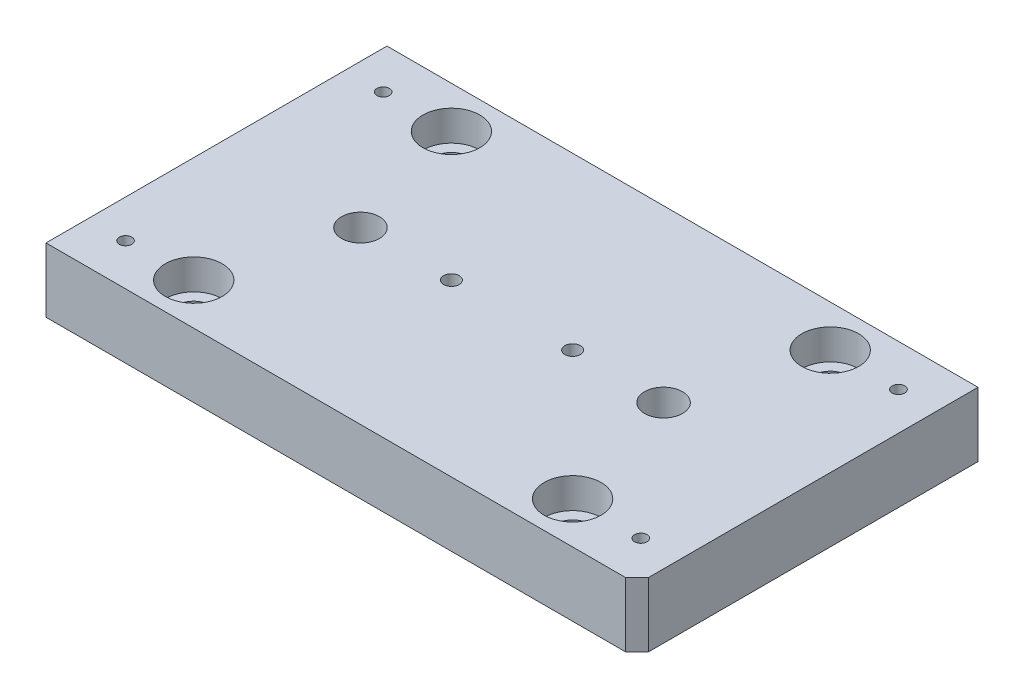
ISO-10303-21;
HEADER;
FILE_DESCRIPTION(('STEP AP214'),'2;1');
FILE_NAME('part.step','',(''),(''),'','','');
FILE_SCHEMA(('AUTOMOTIVE_DESIGN { 1 0 10303 214 1 1 1 1 }'));
ENDSEC;
DATA;
#1=APPLICATION_CONTEXT('core data for automotive mechanical design processes');
#2=APPLICATION_PROTOCOL_DEFINITION('international standard','automotive_design',2000,#1);
#3=PRODUCT_CONTEXT('',#1,'mechanical');
#4=PRODUCT('Part','Part','',(#3));
#5=PRODUCT_RELATED_PRODUCT_CATEGORY('part','',(#4));
#6=PRODUCT_DEFINITION_FORMATION('','',#4);
#7=PRODUCT_DEFINITION_CONTEXT('part definition',#1,'design');
#8=PRODUCT_DEFINITION('design','',#6,#7);
#9=PRODUCT_DEFINITION_SHAPE('','',#8);
#10=(LENGTH_UNIT() NAMED_UNIT(*) SI_UNIT(.MILLI.,.METRE.));
#11=(NAMED_UNIT(*) PLANE_ANGLE_UNIT() SI_UNIT($,.RADIAN.));
#12=(NAMED_UNIT(*) SI_UNIT($,.STERADIAN.) SOLID_ANGLE_UNIT());
#13=UNCERTAINTY_MEASURE_WITH_UNIT(LENGTH_MEASURE(1.E-05),#10,'distance_accuracy_value','');
#14=(GEOMETRIC_REPRESENTATION_CONTEXT(3) GLOBAL_UNCERTAINTY_ASSIGNED_CONTEXT((#13)) GLOBAL_UNIT_ASSIGNED_CONTEXT((#10,
#11,#12)) REPRESENTATION_CONTEXT('',''));
#15=CARTESIAN_POINT('',(0.,0.,0.));
#16=DIRECTION('',(0.,0.,1.));
#17=DIRECTION('',(1.,0.,0.));
#18=AXIS2_PLACEMENT_3D('',#15,#16,#17);
#19=CARTESIAN_POINT('',(-16.,0.,0.));
#20=DIRECTION('',(0.,1.,0.));
#21=DIRECTION('',(0.,0.,1.));
#22=AXIS2_PLACEMENT_3D('',#19,#20,#21);
#23=CYLINDRICAL_SURFACE('',#22,2.05);
#24=CARTESIAN_POINT('',(-16.,17.,0.));
#25=DIRECTION('',(0.,1.,0.));
#26=DIRECTION('',(0.,0.,1.));
#27=AXIS2_PLACEMENT_3D('',#24,#25,#26);
#28=CIRCLE('',#27,2.05);
#29=CARTESIAN_POINT('',(-16.,17.,2.05));
#30=VERTEX_POINT('',#29);
#31=EDGE_CURVE('E174',#30,#30,#28,.T.);
#32=ORIENTED_EDGE('',*,*,#31,.T.);
#33=EDGE_LOOP('',(#32));
#34=FACE_BOUND('',#33,.T.);
#35=CARTESIAN_POINT('',(-16.,8.,0.));
#36=DIRECTION('',(0.,-1.,0.));
#37=DIRECTION('',(0.,0.,-1.));
#38=AXIS2_PLACEMENT_3D('',#35,#36,#37);
#39=CIRCLE('',#38,2.05);
#40=CARTESIAN_POINT('',(-16.,8.,-2.05));
#41=VERTEX_POINT('',#40);
#42=EDGE_CURVE('E176',#41,#41,#39,.F.);
#43=ORIENTED_EDGE('',*,*,#42,.F.);
#44=EDGE_LOOP('',(#43));
#45=FACE_BOUND('',#44,.T.);
#46=ADVANCED_FACE('F50',(#34,#45),#23,.F.);
#47=CARTESIAN_POINT('',(16.,0.,0.));
#48=DIRECTION('',(0.,1.,0.));
#49=DIRECTION('',(0.,0.,1.));
#50=AXIS2_PLACEMENT_3D('',#47,#48,#49);
#51=CYLINDRICAL_SURFACE('',#50,2.05);
#52=CARTESIAN_POINT('',(16.,17.,0.));
#53=DIRECTION('',(0.,1.,0.));
#54=DIRECTION('',(0.,0.,1.));
#55=AXIS2_PLACEMENT_3D('',#52,#53,#54);
#56=CIRCLE('',#55,2.05);
#57=CARTESIAN_POINT('',(16.,17.,2.05));
#58=VERTEX_POINT('',#57);
#59=EDGE_CURVE('E627',#58,#58,#56,.T.);
#60=ORIENTED_EDGE('',*,*,#59,.T.);
#61=EDGE_LOOP('',(#60));
#62=FACE_BOUND('',#61,.T.);
#63=CARTESIAN_POINT('',(16.,8.,0.));
#64=DIRECTION('',(0.,-1.,0.));
#65=DIRECTION('',(0.,0.,-1.));
#66=AXIS2_PLACEMENT_3D('',#63,#64,#65);
#67=CIRCLE('',#66,2.05);
#68=CARTESIAN_POINT('',(16.,8.,-2.05));
#69=VERTEX_POINT('',#68);
#70=EDGE_CURVE('E171',#69,#69,#67,.F.);
#71=ORIENTED_EDGE('',*,*,#70,.F.);
#72=EDGE_LOOP('',(#71));
#73=FACE_BOUND('',#72,.T.);
#74=ADVANCED_FACE('F217',(#62,#73),#51,.F.);
#75=CARTESIAN_POINT('',(-78.,17.,-45.));
#76=DIRECTION('',(1.,0.,0.));
#77=DIRECTION('',(0.,0.,-1.));
#78=AXIS2_PLACEMENT_3D('',#75,#76,#77);
#79=PLANE('',#78);
#80=DIRECTION('',(0.,0.,1.));
#81=VECTOR('',#80,1.);
#82=CARTESIAN_POINT('',(-78.,0.,-45.));
#83=LINE('',#82,#81);
#84=CARTESIAN_POINT('',(-78.,0.,-45.));
#85=VERTEX_POINT('',#84);
#86=CARTESIAN_POINT('',(-78.,0.,45.));
#87=VERTEX_POINT('',#86);
#88=EDGE_CURVE('E143',#85,#87,#83,.T.);
#89=ORIENTED_EDGE('',*,*,#88,.T.);
#90=DIRECTION('',(0.,-1.,0.));
#91=VECTOR('',#90,1.);
#92=CARTESIAN_POINT('',(-78.,17.,45.));
#93=LINE('',#92,#91);
#94=CARTESIAN_POINT('',(-78.,17.,45.));
#95=VERTEX_POINT('',#94);
#96=EDGE_CURVE('E167',#95,#87,#93,.T.);
#97=ORIENTED_EDGE('',*,*,#96,.F.);
#98=DIRECTION('',(0.,0.,1.));
#99=VECTOR('',#98,1.);
#100=CARTESIAN_POINT('',(-78.,17.,-45.));
#101=LINE('',#100,#99);
#102=CARTESIAN_POINT('',(-78.,17.,-45.));
#103=VERTEX_POINT('',#102);
#104=EDGE_CURVE('E152',#103,#95,#101,.T.);
#105=ORIENTED_EDGE('',*,*,#104,.F.);
#106=DIRECTION('',(0.,-1.,0.));
#107=VECTOR('',#106,1.);
#108=CARTESIAN_POINT('',(-78.,17.,-45.));
#109=LINE('',#108,#107);
#110=EDGE_CURVE('E161',#103,#85,#109,.T.);
#111=ORIENTED_EDGE('',*,*,#110,.T.);
#112=EDGE_LOOP('',(#89,#97,#105,#111));
#113=FACE_BOUND('',#112,.T.);
#114=ADVANCED_FACE('F199',(#113),#79,.F.);
#115=CARTESIAN_POINT('',(-78.,17.,45.));
#116=DIRECTION('',(0.,0.,-1.));
#117=DIRECTION('',(-1.,0.,0.));
#118=AXIS2_PLACEMENT_3D('',#115,#116,#117);
#119=PLANE('',#118);
#120=DIRECTION('',(1.,0.,0.));
#121=VECTOR('',#120,1.);
#122=CARTESIAN_POINT('',(-78.,0.,45.));
#123=LINE('',#122,#121);
#124=CARTESIAN_POINT('',(75.,0.,45.));
#125=VERTEX_POINT('',#124);
#126=EDGE_CURVE('E146',#87,#125,#123,.T.);
#127=ORIENTED_EDGE('',*,*,#126,.T.);
#128=DIRECTION('',(0.,1.,0.));
#129=VECTOR('',#128,1.);
#130=CARTESIAN_POINT('',(75.,17.,45.));
#131=LINE('',#130,#129);
#132=CARTESIAN_POINT('',(75.,17.,45.));
#133=VERTEX_POINT('',#132);
#134=EDGE_CURVE('E58',#125,#133,#131,.T.);
#135=ORIENTED_EDGE('',*,*,#134,.T.);
#136=DIRECTION('',(1.,0.,0.));
#137=VECTOR('',#136,1.);
#138=CARTESIAN_POINT('',(-78.,17.,45.));
#139=LINE('',#138,#137);
#140=EDGE_CURVE('E155',#95,#133,#139,.T.);
#141=ORIENTED_EDGE('',*,*,#140,.F.);
#142=ORIENTED_EDGE('',*,*,#96,.T.);
#143=EDGE_LOOP('',(#127,#135,#141,#142));
#144=FACE_BOUND('',#143,.T.);
#145=ADVANCED_FACE('F315',(#144),#119,.F.);
#146=CARTESIAN_POINT('',(78.,17.,-45.));
#147=DIRECTION('',(-1.,0.,0.));
#148=DIRECTION('',(0.,0.,1.));
#149=AXIS2_PLACEMENT_3D('',#146,#147,#148);
#150=PLANE('',#149);
#151=DIRECTION('',(0.,0.,-1.));
#152=VECTOR('',#151,1.);
#153=CARTESIAN_POINT('',(78.,17.,-45.));
#154=LINE('',#153,#152);
#155=CARTESIAN_POINT('',(78.,17.,42.));
#156=VERTEX_POINT('',#155);
#157=CARTESIAN_POINT('',(78.,17.,-45.));
#158=VERTEX_POINT('',#157);
#159=EDGE_CURVE('E157',#156,#158,#154,.T.);
#160=ORIENTED_EDGE('',*,*,#159,.F.);
#161=DIRECTION('',(0.,-1.,0.));
#162=VECTOR('',#161,1.);
#163=CARTESIAN_POINT('',(78.,17.,42.));
#164=LINE('',#163,#162);
#165=CARTESIAN_POINT('',(78.,0.,42.));
#166=VERTEX_POINT('',#165);
#167=EDGE_CURVE('E170',#156,#166,#164,.T.);
#168=ORIENTED_EDGE('',*,*,#167,.T.);
#169=DIRECTION('',(0.,0.,-1.));
#170=VECTOR('',#169,1.);
#171=CARTESIAN_POINT('',(78.,0.,-45.));
#172=LINE('',#171,#170);
#173=CARTESIAN_POINT('',(78.,0.,-45.));
#174=VERTEX_POINT('',#173);
#175=EDGE_CURVE('E148',#166,#174,#172,.T.);
#176=ORIENTED_EDGE('',*,*,#175,.T.);
#177=DIRECTION('',(0.,-1.,0.));
#178=VECTOR('',#177,1.);
#179=CARTESIAN_POINT('',(78.,17.,-45.));
#180=LINE('',#179,#178);
#181=EDGE_CURVE('E164',#158,#174,#180,.T.);
#182=ORIENTED_EDGE('',*,*,#181,.F.);
#183=EDGE_LOOP('',(#160,#168,#176,#182));
#184=FACE_BOUND('',#183,.T.);
#185=ADVANCED_FACE('F186',(#184),#150,.F.);
#186=CARTESIAN_POINT('',(-78.,17.,-45.));
#187=DIRECTION('',(0.,0.,1.));
#188=DIRECTION('',(1.,0.,0.));
#189=AXIS2_PLACEMENT_3D('',#186,#187,#188);
#190=PLANE('',#189);
#191=DIRECTION('',(-1.,0.,0.));
#192=VECTOR('',#191,1.);
#193=CARTESIAN_POINT('',(-78.,0.,-45.));
#194=LINE('',#193,#192);
#195=EDGE_CURVE('E150',#174,#85,#194,.T.);
#196=ORIENTED_EDGE('',*,*,#195,.T.);
#197=ORIENTED_EDGE('',*,*,#110,.F.);
#198=DIRECTION('',(-1.,0.,0.));
#199=VECTOR('',#198,1.);
#200=CARTESIAN_POINT('',(-78.,17.,-45.));
#201=LINE('',#200,#199);
#202=EDGE_CURVE('E159',#158,#103,#201,.T.);
#203=ORIENTED_EDGE('',*,*,#202,.F.);
#204=ORIENTED_EDGE('',*,*,#181,.T.);
#205=EDGE_LOOP('',(#196,#197,#203,#204));
#206=FACE_BOUND('',#205,.T.);
#207=ADVANCED_FACE('F195',(#206),#190,.F.);
#208=CARTESIAN_POINT('',(-78.,17.,45.));
#209=DIRECTION('',(0.,1.,0.));
#210=DIRECTION('',(0.,0.,1.));
#211=AXIS2_PLACEMENT_3D('',#208,#209,#210);
#212=PLANE('',#211);
#213=CARTESIAN_POINT('',(-40.,17.,0.));
#214=DIRECTION('',(0.,-1.,0.));
#215=DIRECTION('',(0.,0.,-1.));
#216=AXIS2_PLACEMENT_3D('',#213,#214,#215);
#217=CIRCLE('',#216,5.);
#218=CARTESIAN_POINT('',(-40.,17.,-5.));
#219=VERTEX_POINT('',#218);
#220=EDGE_CURVE('E604',#219,#219,#217,.T.);
#221=ORIENTED_EDGE('',*,*,#220,.T.);
#222=EDGE_LOOP('',(#221));
#223=FACE_BOUND('',#222,.T.);
#224=CARTESIAN_POINT('',(40.,17.,0.));
#225=DIRECTION('',(0.,-1.,0.));
#226=DIRECTION('',(0.,0.,-1.));
#227=AXIS2_PLACEMENT_3D('',#224,#225,#226);
#228=CIRCLE('',#227,5.);
#229=CARTESIAN_POINT('',(40.,17.,-5.));
#230=VERTEX_POINT('',#229);
#231=EDGE_CURVE('E612',#230,#230,#228,.T.);
#232=ORIENTED_EDGE('',*,*,#231,.T.);
#233=EDGE_LOOP('',(#232));
#234=FACE_BOUND('',#233,.T.);
#235=ORIENTED_EDGE('',*,*,#31,.F.);
#236=EDGE_LOOP('',(#235));
#237=FACE_BOUND('',#236,.T.);
#238=ORIENTED_EDGE('',*,*,#59,.F.);
#239=EDGE_LOOP('',(#238));
#240=FACE_BOUND('',#239,.T.);
#241=CARTESIAN_POINT('',(50.,17.,34.));
#242=DIRECTION('',(0.,1.,0.));
#243=DIRECTION('',(0.,0.,1.));
#244=AXIS2_PLACEMENT_3D('',#241,#242,#243);
#245=CIRCLE('',#244,7.5);
#246=CARTESIAN_POINT('',(50.,17.,41.5));
#247=VERTEX_POINT('',#246);
#248=EDGE_CURVE('E630',#247,#247,#245,.T.);
#249=ORIENTED_EDGE('',*,*,#248,.F.);
#250=EDGE_LOOP('',(#249));
#251=FACE_BOUND('',#250,.T.);
#252=CARTESIAN_POINT('',(50.,17.,-34.));
#253=DIRECTION('',(0.,1.,0.));
#254=DIRECTION('',(0.,0.,1.));
#255=AXIS2_PLACEMENT_3D('',#252,#253,#254);
#256=CIRCLE('',#255,7.5);
#257=CARTESIAN_POINT('',(50.,17.,-26.5));
#258=VERTEX_POINT('',#257);
#259=EDGE_CURVE('E642',#258,#258,#256,.T.);
#260=ORIENTED_EDGE('',*,*,#259,.F.);
#261=EDGE_LOOP('',(#260));
#262=FACE_BOUND('',#261,.T.);
#263=CARTESIAN_POINT('',(-50.,17.,-34.));
#264=DIRECTION('',(0.,1.,0.));
#265=DIRECTION('',(0.,0.,1.));
#266=AXIS2_PLACEMENT_3D('',#263,#264,#265);
#267=CIRCLE('',#266,7.5);
#268=CARTESIAN_POINT('',(-50.,17.,-26.5));
#269=VERTEX_POINT('',#268);
#270=EDGE_CURVE('E654',#269,#269,#267,.T.);
#271=ORIENTED_EDGE('',*,*,#270,.F.);
#272=EDGE_LOOP('',(#271));
#273=FACE_BOUND('',#272,.T.);
#274=CARTESIAN_POINT('',(-50.,17.,34.));
#275=DIRECTION('',(0.,1.,0.));
#276=DIRECTION('',(0.,0.,1.));
#277=AXIS2_PLACEMENT_3D('',#274,#275,#276);
#278=CIRCLE('',#277,7.5);
#279=CARTESIAN_POINT('',(-50.,17.,41.5));
#280=VERTEX_POINT('',#279);
#281=EDGE_CURVE('E666',#280,#280,#278,.T.);
#282=ORIENTED_EDGE('',*,*,#281,.F.);
#283=EDGE_LOOP('',(#282));
#284=FACE_BOUND('',#283,.T.);
#285=CARTESIAN_POINT('',(68.,17.,34.));
#286=DIRECTION('',(0.,1.,0.));
#287=DIRECTION('',(0.,0.,1.));
#288=AXIS2_PLACEMENT_3D('',#285,#286,#287);
#289=CIRCLE('',#288,1.65);
#290=CARTESIAN_POINT('',(68.,17.,35.65));
#291=VERTEX_POINT('',#290);
#292=EDGE_CURVE('E115',#291,#291,#289,.T.);
#293=ORIENTED_EDGE('',*,*,#292,.F.);
#294=EDGE_LOOP('',(#293));
#295=FACE_BOUND('',#294,.T.);
#296=CARTESIAN_POINT('',(68.,17.,-34.));
#297=DIRECTION('',(0.,1.,0.));
#298=DIRECTION('',(0.,0.,1.));
#299=AXIS2_PLACEMENT_3D('',#296,#297,#298);
#300=CIRCLE('',#299,1.65);
#301=CARTESIAN_POINT('',(68.,17.,-32.35));
#302=VERTEX_POINT('',#301);
#303=EDGE_CURVE('E128',#302,#302,#300,.T.);
#304=ORIENTED_EDGE('',*,*,#303,.F.);
#305=EDGE_LOOP('',(#304));
#306=FACE_BOUND('',#305,.T.);
#307=CARTESIAN_POINT('',(-68.,17.,-34.));
#308=DIRECTION('',(0.,1.,0.));
#309=DIRECTION('',(0.,0.,1.));
#310=AXIS2_PLACEMENT_3D('',#307,#308,#309);
#311=CIRCLE('',#310,1.65);
#312=CARTESIAN_POINT('',(-68.,17.,-32.35));
#313=VERTEX_POINT('',#312);
#314=EDGE_CURVE('E134',#313,#313,#311,.T.);
#315=ORIENTED_EDGE('',*,*,#314,.F.);
#316=EDGE_LOOP('',(#315));
#317=FACE_BOUND('',#316,.T.);
#318=CARTESIAN_POINT('',(-68.,17.,34.));
#319=DIRECTION('',(0.,1.,0.));
#320=DIRECTION('',(0.,0.,1.));
#321=AXIS2_PLACEMENT_3D('',#318,#319,#320);
#322=CIRCLE('',#321,1.65);
#323=CARTESIAN_POINT('',(-68.,17.,35.65));
#324=VERTEX_POINT('',#323);
#325=EDGE_CURVE('E140',#324,#324,#322,.T.);
#326=ORIENTED_EDGE('',*,*,#325,.F.);
#327=EDGE_LOOP('',(#326));
#328=FACE_BOUND('',#327,.T.);
#329=ORIENTED_EDGE('',*,*,#140,.T.);
#330=DIRECTION('',(-0.707106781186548,0.,0.707106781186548));
#331=VECTOR('',#330,1.);
#332=CARTESIAN_POINT('',(-1.5,17.,121.5));
#333=LINE('',#332,#331);
#334=EDGE_CURVE('E13',#133,#156,#333,.F.);
#335=ORIENTED_EDGE('',*,*,#334,.T.);
#336=ORIENTED_EDGE('',*,*,#159,.T.);
#337=ORIENTED_EDGE('',*,*,#202,.T.);
#338=ORIENTED_EDGE('',*,*,#104,.T.);
#339=EDGE_LOOP('',(#329,#335,#336,#337,#338));
#340=FACE_BOUND('',#339,.T.);
#341=ADVANCED_FACE('F202',(#223,#234,#237,#240,#251,#262,#273,#284,#295,#306,#317,#328,#340),
#212,.T.);
#342=CARTESIAN_POINT('',(-78.,0.,45.));
#343=DIRECTION('',(0.,1.,0.));
#344=DIRECTION('',(0.,0.,1.));
#345=AXIS2_PLACEMENT_3D('',#342,#343,#344);
#346=PLANE('',#345);
#347=CARTESIAN_POINT('',(-40.,0.,0.));
#348=DIRECTION('',(0.,-1.,0.));
#349=DIRECTION('',(0.,0.,-1.));
#350=AXIS2_PLACEMENT_3D('',#347,#348,#349);
#351=CIRCLE('',#350,5.);
#352=CARTESIAN_POINT('',(-40.,0.,-5.));
#353=VERTEX_POINT('',#352);
#354=EDGE_CURVE('E607',#353,#353,#351,.T.);
#355=ORIENTED_EDGE('',*,*,#354,.F.);
#356=EDGE_LOOP('',(#355));
#357=FACE_BOUND('',#356,.T.);
#358=CARTESIAN_POINT('',(40.,0.,0.));
#359=DIRECTION('',(0.,-1.,0.));
#360=DIRECTION('',(0.,0.,-1.));
#361=AXIS2_PLACEMENT_3D('',#358,#359,#360);
#362=CIRCLE('',#361,5.);
#363=CARTESIAN_POINT('',(40.,0.,-5.));
#364=VERTEX_POINT('',#363);
#365=EDGE_CURVE('E609',#364,#364,#362,.T.);
#366=ORIENTED_EDGE('',*,*,#365,.F.);
#367=EDGE_LOOP('',(#366));
#368=FACE_BOUND('',#367,.T.);
#369=CARTESIAN_POINT('',(-16.,0.,0.));
#370=DIRECTION('',(0.,-1.,0.));
#371=DIRECTION('',(0.,0.,-1.));
#372=AXIS2_PLACEMENT_3D('',#369,#370,#371);
#373=CIRCLE('',#372,4.5);
#374=CARTESIAN_POINT('',(-16.,0.,-4.5));
#375=VERTEX_POINT('',#374);
#376=EDGE_CURVE('E615',#375,#375,#373,.T.);
#377=ORIENTED_EDGE('',*,*,#376,.F.);
#378=EDGE_LOOP('',(#377));
#379=FACE_BOUND('',#378,.T.);
#380=CARTESIAN_POINT('',(16.,0.,0.));
#381=DIRECTION('',(0.,-1.,0.));
#382=DIRECTION('',(0.,0.,-1.));
#383=AXIS2_PLACEMENT_3D('',#380,#381,#382);
#384=CIRCLE('',#383,4.5);
#385=CARTESIAN_POINT('',(16.,0.,-4.5));
#386=VERTEX_POINT('',#385);
#387=EDGE_CURVE('E179',#386,#386,#384,.T.);
#388=ORIENTED_EDGE('',*,*,#387,.F.);
#389=EDGE_LOOP('',(#388));
#390=FACE_BOUND('',#389,.T.);
#391=CARTESIAN_POINT('',(50.,0.,34.));
#392=DIRECTION('',(0.,1.,0.));
#393=DIRECTION('',(0.,0.,1.));
#394=AXIS2_PLACEMENT_3D('',#391,#392,#393);
#395=CIRCLE('',#394,4.5);
#396=CARTESIAN_POINT('',(50.,0.,38.5));
#397=VERTEX_POINT('',#396);
#398=EDGE_CURVE('E639',#397,#397,#395,.T.);
#399=ORIENTED_EDGE('',*,*,#398,.T.);
#400=EDGE_LOOP('',(#399));
#401=FACE_BOUND('',#400,.T.);
#402=CARTESIAN_POINT('',(50.,0.,-34.));
#403=DIRECTION('',(0.,1.,0.));
#404=DIRECTION('',(0.,0.,1.));
#405=AXIS2_PLACEMENT_3D('',#402,#403,#404);
#406=CIRCLE('',#405,4.5);
#407=CARTESIAN_POINT('',(50.,0.,-29.5));
#408=VERTEX_POINT('',#407);
#409=EDGE_CURVE('E651',#408,#408,#406,.T.);
#410=ORIENTED_EDGE('',*,*,#409,.T.);
#411=EDGE_LOOP('',(#410));
#412=FACE_BOUND('',#411,.T.);
#413=CARTESIAN_POINT('',(-50.,0.,-34.));
#414=DIRECTION('',(0.,1.,0.));
#415=DIRECTION('',(0.,0.,1.));
#416=AXIS2_PLACEMENT_3D('',#413,#414,#415);
#417=CIRCLE('',#416,4.5);
#418=CARTESIAN_POINT('',(-50.,0.,-29.5));
#419=VERTEX_POINT('',#418);
#420=EDGE_CURVE('E663',#419,#419,#417,.T.);
#421=ORIENTED_EDGE('',*,*,#420,.T.);
#422=EDGE_LOOP('',(#421));
#423=FACE_BOUND('',#422,.T.);
#424=CARTESIAN_POINT('',(-50.,0.,34.));
#425=DIRECTION('',(0.,1.,0.));
#426=DIRECTION('',(0.,0.,1.));
#427=AXIS2_PLACEMENT_3D('',#424,#425,#426);
#428=CIRCLE('',#427,4.5);
#429=CARTESIAN_POINT('',(-50.,0.,38.5));
#430=VERTEX_POINT('',#429);
#431=EDGE_CURVE('E116',#430,#430,#428,.T.);
#432=ORIENTED_EDGE('',*,*,#431,.T.);
#433=EDGE_LOOP('',(#432));
#434=FACE_BOUND('',#433,.T.);
#435=ORIENTED_EDGE('',*,*,#175,.F.);
#436=DIRECTION('',(0.707106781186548,0.,-0.707106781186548));
#437=VECTOR('',#436,1.);
#438=CARTESIAN_POINT('',(78.,0.,42.));
#439=LINE('',#438,#437);
#440=EDGE_CURVE('E72',#166,#125,#439,.F.);
#441=ORIENTED_EDGE('',*,*,#440,.T.);
#442=ORIENTED_EDGE('',*,*,#126,.F.);
#443=ORIENTED_EDGE('',*,*,#88,.F.);
#444=ORIENTED_EDGE('',*,*,#195,.F.);
#445=EDGE_LOOP('',(#435,#441,#442,#443,#444));
#446=FACE_BOUND('',#445,.T.);
#447=ADVANCED_FACE('F191',(#357,#368,#379,#390,#401,#412,#423,#434,#446),#346,.F.);
#448=CARTESIAN_POINT('',(-68.,17.,34.));
#449=DIRECTION('',(0.,1.,0.));
#450=DIRECTION('',(0.,0.,1.));
#451=AXIS2_PLACEMENT_3D('',#448,#449,#450);
#452=CYLINDRICAL_SURFACE('',#451,1.65);
#453=CARTESIAN_POINT('',(-68.,6.9,34.));
#454=DIRECTION('',(0.,1.,0.));
#455=DIRECTION('',(0.,0.,1.));
#456=AXIS2_PLACEMENT_3D('',#453,#454,#455);
#457=CIRCLE('',#456,1.65);
#458=CARTESIAN_POINT('',(-68.,6.9,35.65));
#459=VERTEX_POINT('',#458);
#460=EDGE_CURVE('E137',#459,#459,#457,.T.);
#461=ORIENTED_EDGE('',*,*,#460,.F.);
#462=EDGE_LOOP('',(#461));
#463=FACE_BOUND('',#462,.T.);
#464=ORIENTED_EDGE('',*,*,#325,.T.);
#465=EDGE_LOOP('',(#464));
#466=FACE_BOUND('',#465,.T.);
#467=ADVANCED_FACE('F300',(#463,#466),#452,.F.);
#468=CARTESIAN_POINT('',(-68.,6.9,34.));
#469=DIRECTION('',(0.,1.,0.));
#470=DIRECTION('',(0.,0.,1.));
#471=AXIS2_PLACEMENT_3D('',#468,#469,#470);
#472=CONICAL_SURFACE('',#471,1.65,1.02974425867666);
#473=CARTESIAN_POINT('',(-68.,5.90857997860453,34.));
#474=VERTEX_POINT('',#473);
#475=VERTEX_LOOP('',#474);
#476=FACE_BOUND('',#475,.T.);
#477=ORIENTED_EDGE('',*,*,#460,.T.);
#478=EDGE_LOOP('',(#477));
#479=FACE_BOUND('',#478,.T.);
#480=ADVANCED_FACE('F296',(#476,#479),#472,.F.);
#481=CARTESIAN_POINT('',(-68.,17.,-34.));
#482=DIRECTION('',(0.,1.,0.));
#483=DIRECTION('',(0.,0.,1.));
#484=AXIS2_PLACEMENT_3D('',#481,#482,#483);
#485=CYLINDRICAL_SURFACE('',#484,1.65);
#486=CARTESIAN_POINT('',(-68.,6.9,-34.));
#487=DIRECTION('',(0.,1.,0.));
#488=DIRECTION('',(0.,0.,1.));
#489=AXIS2_PLACEMENT_3D('',#486,#487,#488);
#490=CIRCLE('',#489,1.65);
#491=CARTESIAN_POINT('',(-68.,6.9,-32.35));
#492=VERTEX_POINT('',#491);
#493=EDGE_CURVE('E131',#492,#492,#490,.T.);
#494=ORIENTED_EDGE('',*,*,#493,.F.);
#495=EDGE_LOOP('',(#494));
#496=FACE_BOUND('',#495,.T.);
#497=ORIENTED_EDGE('',*,*,#314,.T.);
#498=EDGE_LOOP('',(#497));
#499=FACE_BOUND('',#498,.T.);
#500=ADVANCED_FACE('F292',(#496,#499),#485,.F.);
#501=CARTESIAN_POINT('',(-68.,6.9,-34.));
#502=DIRECTION('',(0.,1.,0.));
#503=DIRECTION('',(0.,0.,1.));
#504=AXIS2_PLACEMENT_3D('',#501,#502,#503);
#505=CONICAL_SURFACE('',#504,1.65,1.02974425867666);
#506=CARTESIAN_POINT('',(-68.,5.90857997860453,-34.));
#507=VERTEX_POINT('',#506);
#508=VERTEX_LOOP('',#507);
#509=FACE_BOUND('',#508,.T.);
#510=ORIENTED_EDGE('',*,*,#493,.T.);
#511=EDGE_LOOP('',(#510));
#512=FACE_BOUND('',#511,.T.);
#513=ADVANCED_FACE('F288',(#509,#512),#505,.F.);
#514=CARTESIAN_POINT('',(68.,17.,-34.));
#515=DIRECTION('',(0.,1.,0.));
#516=DIRECTION('',(0.,0.,1.));
#517=AXIS2_PLACEMENT_3D('',#514,#515,#516);
#518=CYLINDRICAL_SURFACE('',#517,1.65);
#519=CARTESIAN_POINT('',(68.,6.9,-34.));
#520=DIRECTION('',(0.,1.,0.));
#521=DIRECTION('',(0.,0.,1.));
#522=AXIS2_PLACEMENT_3D('',#519,#520,#521);
#523=CIRCLE('',#522,1.65);
#524=CARTESIAN_POINT('',(68.,6.9,-32.35));
#525=VERTEX_POINT('',#524);
#526=EDGE_CURVE('E119',#525,#525,#523,.T.);
#527=ORIENTED_EDGE('',*,*,#526,.F.);
#528=EDGE_LOOP('',(#527));
#529=FACE_BOUND('',#528,.T.);
#530=ORIENTED_EDGE('',*,*,#303,.T.);
#531=EDGE_LOOP('',(#530));
#532=FACE_BOUND('',#531,.T.);
#533=ADVANCED_FACE('F284',(#529,#532),#518,.F.);
#534=CARTESIAN_POINT('',(68.,6.9,-34.));
#535=DIRECTION('',(0.,1.,0.));
#536=DIRECTION('',(0.,0.,1.));
#537=AXIS2_PLACEMENT_3D('',#534,#535,#536);
#538=CONICAL_SURFACE('',#537,1.65,1.02974425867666);
#539=CARTESIAN_POINT('',(68.,5.90857997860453,-34.));
#540=VERTEX_POINT('',#539);
#541=VERTEX_LOOP('',#540);
#542=FACE_BOUND('',#541,.T.);
#543=ORIENTED_EDGE('',*,*,#526,.T.);
#544=EDGE_LOOP('',(#543));
#545=FACE_BOUND('',#544,.T.);
#546=ADVANCED_FACE('F281',(#542,#545),#538,.F.);
#547=CARTESIAN_POINT('',(68.,17.,34.));
#548=DIRECTION('',(0.,1.,0.));
#549=DIRECTION('',(0.,0.,1.));
#550=AXIS2_PLACEMENT_3D('',#547,#548,#549);
#551=CYLINDRICAL_SURFACE('',#550,1.65);
#552=CARTESIAN_POINT('',(68.,6.9,34.));
#553=DIRECTION('',(0.,1.,0.));
#554=DIRECTION('',(0.,0.,1.));
#555=AXIS2_PLACEMENT_3D('',#552,#553,#554);
#556=CIRCLE('',#555,1.65);
#557=CARTESIAN_POINT('',(68.,6.9,35.65));
#558=VERTEX_POINT('',#557);
#559=EDGE_CURVE('E113',#558,#558,#556,.T.);
#560=ORIENTED_EDGE('',*,*,#559,.F.);
#561=EDGE_LOOP('',(#560));
#562=FACE_BOUND('',#561,.T.);
#563=ORIENTED_EDGE('',*,*,#292,.T.);
#564=EDGE_LOOP('',(#563));
#565=FACE_BOUND('',#564,.T.);
#566=ADVANCED_FACE('F109',(#562,#565),#551,.F.);
#567=CARTESIAN_POINT('',(68.,6.9,34.));
#568=DIRECTION('',(0.,1.,0.));
#569=DIRECTION('',(0.,0.,1.));
#570=AXIS2_PLACEMENT_3D('',#567,#568,#569);
#571=CONICAL_SURFACE('',#570,1.65,1.02974425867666);
#572=CARTESIAN_POINT('',(68.,5.90857997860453,34.));
#573=VERTEX_POINT('',#572);
#574=VERTEX_LOOP('',#573);
#575=FACE_BOUND('',#574,.T.);
#576=ORIENTED_EDGE('',*,*,#559,.T.);
#577=EDGE_LOOP('',(#576));
#578=FACE_BOUND('',#577,.T.);
#579=ADVANCED_FACE('F105',(#575,#578),#571,.F.);
#580=CARTESIAN_POINT('',(-50.,17.,34.));
#581=DIRECTION('',(0.,1.,0.));
#582=DIRECTION('',(0.,0.,1.));
#583=AXIS2_PLACEMENT_3D('',#580,#581,#582);
#584=CYLINDRICAL_SURFACE('',#583,4.5);
#585=ORIENTED_EDGE('',*,*,#431,.F.);
#586=EDGE_LOOP('',(#585));
#587=FACE_BOUND('',#586,.T.);
#588=CARTESIAN_POINT('',(-50.,9.,34.));
#589=DIRECTION('',(0.,1.,0.));
#590=DIRECTION('',(0.,0.,1.));
#591=AXIS2_PLACEMENT_3D('',#588,#589,#590);
#592=CIRCLE('',#591,4.5);
#593=CARTESIAN_POINT('',(-50.,9.,38.5));
#594=VERTEX_POINT('',#593);
#595=EDGE_CURVE('E122',#594,#594,#592,.T.);
#596=ORIENTED_EDGE('',*,*,#595,.T.);
#597=EDGE_LOOP('',(#596));
#598=FACE_BOUND('',#597,.T.);
#599=ADVANCED_FACE('F108',(#587,#598),#584,.F.);
#600=CARTESIAN_POINT('',(-45.5,9.,34.));
#601=DIRECTION('',(0.,-1.,0.));
#602=DIRECTION('',(0.,0.,-1.));
#603=AXIS2_PLACEMENT_3D('',#600,#601,#602);
#604=PLANE('',#603);
#605=ORIENTED_EDGE('',*,*,#595,.F.);
#606=EDGE_LOOP('',(#605));
#607=FACE_BOUND('',#606,.T.);
#608=CARTESIAN_POINT('',(-50.,9.,34.));
#609=DIRECTION('',(0.,1.,0.));
#610=DIRECTION('',(0.,0.,1.));
#611=AXIS2_PLACEMENT_3D('',#608,#609,#610);
#612=CIRCLE('',#611,7.5);
#613=CARTESIAN_POINT('',(-50.,9.,41.5));
#614=VERTEX_POINT('',#613);
#615=EDGE_CURVE('E669',#614,#614,#612,.T.);
#616=ORIENTED_EDGE('',*,*,#615,.T.);
#617=EDGE_LOOP('',(#616));
#618=FACE_BOUND('',#617,.T.);
#619=ADVANCED_FACE('F271',(#607,#618),#604,.F.);
#620=CARTESIAN_POINT('',(-50.,17.,34.));
#621=DIRECTION('',(0.,1.,0.));
#622=DIRECTION('',(0.,0.,1.));
#623=AXIS2_PLACEMENT_3D('',#620,#621,#622);
#624=CYLINDRICAL_SURFACE('',#623,7.5);
#625=ORIENTED_EDGE('',*,*,#615,.F.);
#626=EDGE_LOOP('',(#625));
#627=FACE_BOUND('',#626,.T.);
#628=ORIENTED_EDGE('',*,*,#281,.T.);
#629=EDGE_LOOP('',(#628));
#630=FACE_BOUND('',#629,.T.);
#631=ADVANCED_FACE('F267',(#627,#630),#624,.F.);
#632=CARTESIAN_POINT('',(-50.,17.,-34.));
#633=DIRECTION('',(0.,1.,0.));
#634=DIRECTION('',(0.,0.,1.));
#635=AXIS2_PLACEMENT_3D('',#632,#633,#634);
#636=CYLINDRICAL_SURFACE('',#635,4.5);
#637=ORIENTED_EDGE('',*,*,#420,.F.);
#638=EDGE_LOOP('',(#637));
#639=FACE_BOUND('',#638,.T.);
#640=CARTESIAN_POINT('',(-50.,9.,-34.));
#641=DIRECTION('',(0.,1.,0.));
#642=DIRECTION('',(0.,0.,1.));
#643=AXIS2_PLACEMENT_3D('',#640,#641,#642);
#644=CIRCLE('',#643,4.5);
#645=CARTESIAN_POINT('',(-50.,9.,-29.5));
#646=VERTEX_POINT('',#645);
#647=EDGE_CURVE('E660',#646,#646,#644,.T.);
#648=ORIENTED_EDGE('',*,*,#647,.T.);
#649=EDGE_LOOP('',(#648));
#650=FACE_BOUND('',#649,.T.);
#651=ADVANCED_FACE('F263',(#639,#650),#636,.F.);
#652=CARTESIAN_POINT('',(-45.5,9.,-34.));
#653=DIRECTION('',(0.,-1.,0.));
#654=DIRECTION('',(0.,0.,-1.));
#655=AXIS2_PLACEMENT_3D('',#652,#653,#654);
#656=PLANE('',#655);
#657=ORIENTED_EDGE('',*,*,#647,.F.);
#658=EDGE_LOOP('',(#657));
#659=FACE_BOUND('',#658,.T.);
#660=CARTESIAN_POINT('',(-50.,9.,-34.));
#661=DIRECTION('',(0.,1.,0.));
#662=DIRECTION('',(0.,0.,1.));
#663=AXIS2_PLACEMENT_3D('',#660,#661,#662);
#664=CIRCLE('',#663,7.5);
#665=CARTESIAN_POINT('',(-50.,9.,-26.5));
#666=VERTEX_POINT('',#665);
#667=EDGE_CURVE('E657',#666,#666,#664,.T.);
#668=ORIENTED_EDGE('',*,*,#667,.T.);
#669=EDGE_LOOP('',(#668));
#670=FACE_BOUND('',#669,.T.);
#671=ADVANCED_FACE('F259',(#659,#670),#656,.F.);
#672=CARTESIAN_POINT('',(-50.,17.,-34.));
#673=DIRECTION('',(0.,1.,0.));
#674=DIRECTION('',(0.,0.,1.));
#675=AXIS2_PLACEMENT_3D('',#672,#673,#674);
#676=CYLINDRICAL_SURFACE('',#675,7.5);
#677=ORIENTED_EDGE('',*,*,#667,.F.);
#678=EDGE_LOOP('',(#677));
#679=FACE_BOUND('',#678,.T.);
#680=ORIENTED_EDGE('',*,*,#270,.T.);
#681=EDGE_LOOP('',(#680));
#682=FACE_BOUND('',#681,.T.);
#683=ADVANCED_FACE('F255',(#679,#682),#676,.F.);
#684=CARTESIAN_POINT('',(50.,17.,-34.));
#685=DIRECTION('',(0.,1.,0.));
#686=DIRECTION('',(0.,0.,1.));
#687=AXIS2_PLACEMENT_3D('',#684,#685,#686);
#688=CYLINDRICAL_SURFACE('',#687,4.5);
#689=ORIENTED_EDGE('',*,*,#409,.F.);
#690=EDGE_LOOP('',(#689));
#691=FACE_BOUND('',#690,.T.);
#692=CARTESIAN_POINT('',(50.,9.,-34.));
#693=DIRECTION('',(0.,1.,0.));
#694=DIRECTION('',(0.,0.,1.));
#695=AXIS2_PLACEMENT_3D('',#692,#693,#694);
#696=CIRCLE('',#695,4.5);
#697=CARTESIAN_POINT('',(50.,9.,-29.5));
#698=VERTEX_POINT('',#697);
#699=EDGE_CURVE('E648',#698,#698,#696,.T.);
#700=ORIENTED_EDGE('',*,*,#699,.T.);
#701=EDGE_LOOP('',(#700));
#702=FACE_BOUND('',#701,.T.);
#703=ADVANCED_FACE('F251',(#691,#702),#688,.F.);
#704=CARTESIAN_POINT('',(54.5,9.,-34.));
#705=DIRECTION('',(0.,-1.,0.));
#706=DIRECTION('',(0.,0.,-1.));
#707=AXIS2_PLACEMENT_3D('',#704,#705,#706);
#708=PLANE('',#707);
#709=ORIENTED_EDGE('',*,*,#699,.F.);
#710=EDGE_LOOP('',(#709));
#711=FACE_BOUND('',#710,.T.);
#712=CARTESIAN_POINT('',(50.,9.,-34.));
#713=DIRECTION('',(0.,1.,0.));
#714=DIRECTION('',(0.,0.,1.));
#715=AXIS2_PLACEMENT_3D('',#712,#713,#714);
#716=CIRCLE('',#715,7.5);
#717=CARTESIAN_POINT('',(50.,9.,-26.5));
#718=VERTEX_POINT('',#717);
#719=EDGE_CURVE('E645',#718,#718,#716,.T.);
#720=ORIENTED_EDGE('',*,*,#719,.T.);
#721=EDGE_LOOP('',(#720));
#722=FACE_BOUND('',#721,.T.);
#723=ADVANCED_FACE('F247',(#711,#722),#708,.F.);
#724=CARTESIAN_POINT('',(50.,17.,-34.));
#725=DIRECTION('',(0.,1.,0.));
#726=DIRECTION('',(0.,0.,1.));
#727=AXIS2_PLACEMENT_3D('',#724,#725,#726);
#728=CYLINDRICAL_SURFACE('',#727,7.5);
#729=ORIENTED_EDGE('',*,*,#719,.F.);
#730=EDGE_LOOP('',(#729));
#731=FACE_BOUND('',#730,.T.);
#732=ORIENTED_EDGE('',*,*,#259,.T.);
#733=EDGE_LOOP('',(#732));
#734=FACE_BOUND('',#733,.T.);
#735=ADVANCED_FACE('F243',(#731,#734),#728,.F.);
#736=CARTESIAN_POINT('',(50.,17.,34.));
#737=DIRECTION('',(0.,1.,0.));
#738=DIRECTION('',(0.,0.,1.));
#739=AXIS2_PLACEMENT_3D('',#736,#737,#738);
#740=CYLINDRICAL_SURFACE('',#739,4.5);
#741=ORIENTED_EDGE('',*,*,#398,.F.);
#742=EDGE_LOOP('',(#741));
#743=FACE_BOUND('',#742,.T.);
#744=CARTESIAN_POINT('',(50.,9.,34.));
#745=DIRECTION('',(0.,1.,0.));
#746=DIRECTION('',(0.,0.,1.));
#747=AXIS2_PLACEMENT_3D('',#744,#745,#746);
#748=CIRCLE('',#747,4.5);
#749=CARTESIAN_POINT('',(50.,9.,38.5));
#750=VERTEX_POINT('',#749);
#751=EDGE_CURVE('E636',#750,#750,#748,.T.);
#752=ORIENTED_EDGE('',*,*,#751,.T.);
#753=EDGE_LOOP('',(#752));
#754=FACE_BOUND('',#753,.T.);
#755=ADVANCED_FACE('F239',(#743,#754),#740,.F.);
#756=CARTESIAN_POINT('',(54.5,9.,34.));
#757=DIRECTION('',(0.,-1.,0.));
#758=DIRECTION('',(0.,0.,-1.));
#759=AXIS2_PLACEMENT_3D('',#756,#757,#758);
#760=PLANE('',#759);
#761=ORIENTED_EDGE('',*,*,#751,.F.);
#762=EDGE_LOOP('',(#761));
#763=FACE_BOUND('',#762,.T.);
#764=CARTESIAN_POINT('',(50.,9.,34.));
#765=DIRECTION('',(0.,1.,0.));
#766=DIRECTION('',(0.,0.,1.));
#767=AXIS2_PLACEMENT_3D('',#764,#765,#766);
#768=CIRCLE('',#767,7.5);
#769=CARTESIAN_POINT('',(50.,9.,41.5));
#770=VERTEX_POINT('',#769);
#771=EDGE_CURVE('E633',#770,#770,#768,.T.);
#772=ORIENTED_EDGE('',*,*,#771,.T.);
#773=EDGE_LOOP('',(#772));
#774=FACE_BOUND('',#773,.T.);
#775=ADVANCED_FACE('F235',(#763,#774),#760,.F.);
#776=CARTESIAN_POINT('',(50.,17.,34.));
#777=DIRECTION('',(0.,1.,0.));
#778=DIRECTION('',(0.,0.,1.));
#779=AXIS2_PLACEMENT_3D('',#776,#777,#778);
#780=CYLINDRICAL_SURFACE('',#779,7.5);
#781=ORIENTED_EDGE('',*,*,#771,.F.);
#782=EDGE_LOOP('',(#781));
#783=FACE_BOUND('',#782,.T.);
#784=ORIENTED_EDGE('',*,*,#248,.T.);
#785=EDGE_LOOP('',(#784));
#786=FACE_BOUND('',#785,.T.);
#787=ADVANCED_FACE('F231',(#783,#786),#780,.F.);
#788=CARTESIAN_POINT('',(16.,8.,0.));
#789=DIRECTION('',(0.,-1.,0.));
#790=DIRECTION('',(0.,0.,-1.));
#791=AXIS2_PLACEMENT_3D('',#788,#789,#790);
#792=PLANE('',#791);
#793=CARTESIAN_POINT('',(16.,8.,0.));
#794=DIRECTION('',(0.,-1.,0.));
#795=DIRECTION('',(0.,0.,-1.));
#796=AXIS2_PLACEMENT_3D('',#793,#794,#795);
#797=CIRCLE('',#796,4.5);
#798=CARTESIAN_POINT('',(16.,8.,-4.5));
#799=VERTEX_POINT('',#798);
#800=EDGE_CURVE('E175',#799,#799,#797,.T.);
#801=ORIENTED_EDGE('',*,*,#800,.T.);
#802=EDGE_LOOP('',(#801));
#803=FACE_BOUND('',#802,.T.);
#804=ORIENTED_EDGE('',*,*,#70,.T.);
#805=EDGE_LOOP('',(#804));
#806=FACE_BOUND('',#805,.T.);
#807=ADVANCED_FACE('F234',(#803,#806),#792,.T.);
#808=CARTESIAN_POINT('',(16.,8.,0.));
#809=DIRECTION('',(0.,-1.,0.));
#810=DIRECTION('',(0.,0.,-1.));
#811=AXIS2_PLACEMENT_3D('',#808,#809,#810);
#812=CYLINDRICAL_SURFACE('',#811,4.5);
#813=ORIENTED_EDGE('',*,*,#800,.F.);
#814=EDGE_LOOP('',(#813));
#815=FACE_BOUND('',#814,.T.);
#816=ORIENTED_EDGE('',*,*,#387,.T.);
#817=EDGE_LOOP('',(#816));
#818=FACE_BOUND('',#817,.T.);
#819=ADVANCED_FACE('F228',(#815,#818),#812,.F.);
#820=CARTESIAN_POINT('',(-16.,8.,0.));
#821=DIRECTION('',(0.,-1.,0.));
#822=DIRECTION('',(0.,0.,-1.));
#823=AXIS2_PLACEMENT_3D('',#820,#821,#822);
#824=PLANE('',#823);
#825=CARTESIAN_POINT('',(-16.,8.,0.));
#826=DIRECTION('',(0.,-1.,0.));
#827=DIRECTION('',(0.,0.,-1.));
#828=AXIS2_PLACEMENT_3D('',#825,#826,#827);
#829=CIRCLE('',#828,4.5);
#830=CARTESIAN_POINT('',(-16.,8.,-4.5));
#831=VERTEX_POINT('',#830);
#832=EDGE_CURVE('E180',#831,#831,#829,.T.);
#833=ORIENTED_EDGE('',*,*,#832,.T.);
#834=EDGE_LOOP('',(#833));
#835=FACE_BOUND('',#834,.T.);
#836=ORIENTED_EDGE('',*,*,#42,.T.);
#837=EDGE_LOOP('',(#836));
#838=FACE_BOUND('',#837,.T.);
#839=ADVANCED_FACE('F213',(#835,#838),#824,.T.);
#840=CARTESIAN_POINT('',(-16.,8.,0.));
#841=DIRECTION('',(0.,-1.,0.));
#842=DIRECTION('',(0.,0.,-1.));
#843=AXIS2_PLACEMENT_3D('',#840,#841,#842);
#844=CYLINDRICAL_SURFACE('',#843,4.5);
#845=ORIENTED_EDGE('',*,*,#832,.F.);
#846=EDGE_LOOP('',(#845));
#847=FACE_BOUND('',#846,.T.);
#848=ORIENTED_EDGE('',*,*,#376,.T.);
#849=EDGE_LOOP('',(#848));
#850=FACE_BOUND('',#849,.T.);
#851=ADVANCED_FACE('F205',(#847,#850),#844,.F.);
#852=CARTESIAN_POINT('',(78.,17.,42.));
#853=DIRECTION('',(-0.707106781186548,0.,-0.707106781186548));
#854=DIRECTION('',(-0.707106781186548,0.,0.707106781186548));
#855=AXIS2_PLACEMENT_3D('',#852,#853,#854);
#856=PLANE('',#855);
#857=ORIENTED_EDGE('',*,*,#334,.F.);
#858=ORIENTED_EDGE('',*,*,#134,.F.);
#859=ORIENTED_EDGE('',*,*,#440,.F.);
#860=ORIENTED_EDGE('',*,*,#167,.F.);
#861=EDGE_LOOP('',(#857,#858,#859,#860));
#862=FACE_BOUND('',#861,.T.);
#863=ADVANCED_FACE('F52',(#862),#856,.F.);
#864=CARTESIAN_POINT('',(40.,17.,0.));
#865=DIRECTION('',(0.,-1.,0.));
#866=DIRECTION('',(0.,0.,-1.));
#867=AXIS2_PLACEMENT_3D('',#864,#865,#866);
#868=CYLINDRICAL_SURFACE('',#867,5.);
#869=ORIENTED_EDGE('',*,*,#231,.F.);
#870=EDGE_LOOP('',(#869));
#871=FACE_BOUND('',#870,.T.);
#872=ORIENTED_EDGE('',*,*,#365,.T.);
#873=EDGE_LOOP('',(#872));
#874=FACE_BOUND('',#873,.T.);
#875=ADVANCED_FACE('F204',(#871,#874),#868,.F.);
#876=CARTESIAN_POINT('',(-40.,17.,0.));
#877=DIRECTION('',(0.,-1.,0.));
#878=DIRECTION('',(0.,0.,-1.));
#879=AXIS2_PLACEMENT_3D('',#876,#877,#878);
#880=CYLINDRICAL_SURFACE('',#879,5.);
#881=ORIENTED_EDGE('',*,*,#220,.F.);
#882=EDGE_LOOP('',(#881));
#883=FACE_BOUND('',#882,.T.);
#884=ORIENTED_EDGE('',*,*,#354,.T.);
#885=EDGE_LOOP('',(#884));
#886=FACE_BOUND('',#885,.T.);
#887=ADVANCED_FACE('F210',(#883,#886),#880,.F.);
#888=CLOSED_SHELL('',(#46,#74,#114,#145,#185,#207,#341,#447,#467,#480,#500,#513,#533,#546,#566,
#579,#599,#619,#631,#651,#671,#683,#703,#723,#735,#755,#775,#787,#807,#819,#839,#851,#863,#875,#887));
#889=MANIFOLD_SOLID_BREP('B2',#888);
#890=ADVANCED_BREP_SHAPE_REPRESENTATION('',(#18,#889),#14);
#891=SHAPE_DEFINITION_REPRESENTATION(#9,#890);
ENDSEC;
END-ISO-10303-21;
